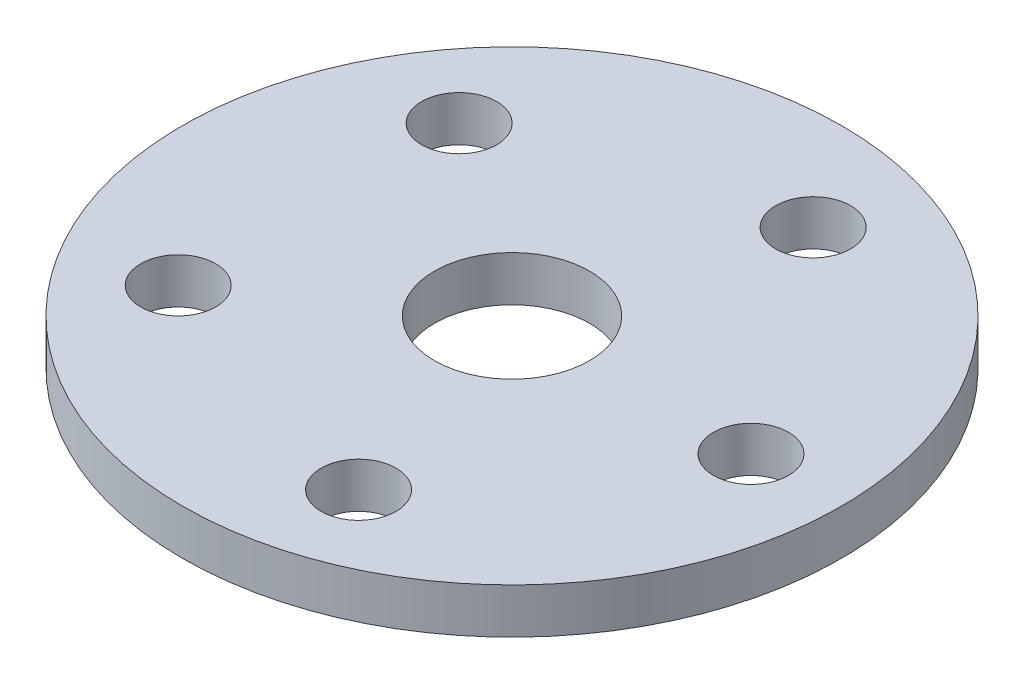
ISO-10303-21;
HEADER;
FILE_DESCRIPTION(('STEP AP214'),'2;1');
FILE_NAME('part.step','',(''),(''),'','','');
FILE_SCHEMA(('AUTOMOTIVE_DESIGN { 1 0 10303 214 1 1 1 1 }'));
ENDSEC;
DATA;
#1=APPLICATION_CONTEXT('core data for automotive mechanical design processes');
#2=APPLICATION_PROTOCOL_DEFINITION('international standard','automotive_design',2000,#1);
#3=PRODUCT_CONTEXT('',#1,'mechanical');
#4=PRODUCT('Part','Part','',(#3));
#5=PRODUCT_RELATED_PRODUCT_CATEGORY('part','',(#4));
#6=PRODUCT_DEFINITION_FORMATION('','',#4);
#7=PRODUCT_DEFINITION_CONTEXT('part definition',#1,'design');
#8=PRODUCT_DEFINITION('design','',#6,#7);
#9=PRODUCT_DEFINITION_SHAPE('','',#8);
#10=(LENGTH_UNIT() NAMED_UNIT(*) SI_UNIT(.MILLI.,.METRE.));
#11=(NAMED_UNIT(*) PLANE_ANGLE_UNIT() SI_UNIT($,.RADIAN.));
#12=(NAMED_UNIT(*) SI_UNIT($,.STERADIAN.) SOLID_ANGLE_UNIT());
#13=UNCERTAINTY_MEASURE_WITH_UNIT(LENGTH_MEASURE(1.E-05),#10,'distance_accuracy_value','');
#14=(GEOMETRIC_REPRESENTATION_CONTEXT(3) GLOBAL_UNCERTAINTY_ASSIGNED_CONTEXT((#13)) GLOBAL_UNIT_ASSIGNED_CONTEXT((#10,
#11,#12)) REPRESENTATION_CONTEXT('',''));
#15=CARTESIAN_POINT('',(0.,0.,0.));
#16=DIRECTION('',(0.,0.,1.));
#17=DIRECTION('',(1.,0.,0.));
#18=AXIS2_PLACEMENT_3D('',#15,#16,#17);
#19=CARTESIAN_POINT('',(0.,8.89,0.));
#20=DIRECTION('',(0.,-1.,0.));
#21=DIRECTION('',(0.,0.,-1.));
#22=AXIS2_PLACEMENT_3D('',#19,#20,#21);
#23=CYLINDRICAL_SURFACE('',#22,64.7558655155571);
#24=CARTESIAN_POINT('',(0.,8.89,0.));
#25=DIRECTION('',(0.,1.,0.));
#26=DIRECTION('',(0.,0.,1.));
#27=AXIS2_PLACEMENT_3D('',#24,#25,#26);
#28=CIRCLE('',#27,64.7558655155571);
#29=CARTESIAN_POINT('',(0.,8.89,64.7558655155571));
#30=VERTEX_POINT('',#29);
#31=EDGE_CURVE('E10',#30,#30,#28,.T.);
#32=ORIENTED_EDGE('',*,*,#31,.F.);
#33=EDGE_LOOP('',(#32));
#34=FACE_BOUND('',#33,.T.);
#35=CARTESIAN_POINT('',(0.,0.,0.));
#36=DIRECTION('',(0.,1.,0.));
#37=DIRECTION('',(0.,0.,1.));
#38=AXIS2_PLACEMENT_3D('',#35,#36,#37);
#39=CIRCLE('',#38,64.7558655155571);
#40=CARTESIAN_POINT('',(0.,0.,64.7558655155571));
#41=VERTEX_POINT('',#40);
#42=EDGE_CURVE('E31',#41,#41,#39,.T.);
#43=ORIENTED_EDGE('',*,*,#42,.T.);
#44=EDGE_LOOP('',(#43));
#45=FACE_BOUND('',#44,.T.);
#46=ADVANCED_FACE('F28',(#34,#45),#23,.T.);
#47=CARTESIAN_POINT('',(0.,8.89,0.));
#48=DIRECTION('',(0.,1.,0.));
#49=DIRECTION('',(0.,0.,1.));
#50=AXIS2_PLACEMENT_3D('',#47,#48,#49);
#51=PLANE('',#50);
#52=CARTESIAN_POINT('',(14.5105613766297,8.89,-44.6589158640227));
#53=DIRECTION('',(0.,1.,0.));
#54=DIRECTION('',(0.95105651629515,0.,0.309016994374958));
#55=AXIS2_PLACEMENT_3D('',#52,#53,#54);
#56=CIRCLE('',#55,7.36688649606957);
#57=CARTESIAN_POINT('',(21.5168867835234,8.89,-42.3824227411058));
#58=VERTEX_POINT('',#57);
#59=EDGE_CURVE('E70',#58,#58,#56,.T.);
#60=ORIENTED_EDGE('',*,*,#59,.F.);
#61=EDGE_LOOP('',(#60));
#62=FACE_BOUND('',#61,.T.);
#63=CARTESIAN_POINT('',(-37.9891428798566,8.89,-27.6007279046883));
#64=DIRECTION('',(0.,1.,0.));
#65=DIRECTION('',(0.58778525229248,0.,-0.809016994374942));
#66=AXIS2_PLACEMENT_3D('',#63,#64,#65);
#67=CIRCLE('',#66,7.36688649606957);
#68=CARTESIAN_POINT('',(-33.6589956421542,8.89,-33.5606642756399));
#69=VERTEX_POINT('',#68);
#70=EDGE_CURVE('E64',#69,#69,#67,.T.);
#71=ORIENTED_EDGE('',*,*,#70,.F.);
#72=EDGE_LOOP('',(#71));
#73=FACE_BOUND('',#72,.T.);
#74=CARTESIAN_POINT('',(-37.9891428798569,8.89,27.6007279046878));
#75=DIRECTION('',(0.,1.,0.));
#76=DIRECTION('',(-0.587785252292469,0.,-0.809016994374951));
#77=AXIS2_PLACEMENT_3D('',#74,#75,#76);
#78=CIRCLE('',#77,7.36688649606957);
#79=CARTESIAN_POINT('',(-42.3192901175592,8.89,21.6407915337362));
#80=VERTEX_POINT('',#79);
#81=EDGE_CURVE('E58',#80,#80,#78,.T.);
#82=ORIENTED_EDGE('',*,*,#81,.F.);
#83=EDGE_LOOP('',(#82));
#84=FACE_BOUND('',#83,.T.);
#85=CARTESIAN_POINT('',(14.5105613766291,8.89,44.6589158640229));
#86=DIRECTION('',(0.,1.,0.));
#87=DIRECTION('',(-0.951056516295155,0.,0.309016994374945));
#88=AXIS2_PLACEMENT_3D('',#85,#86,#87);
#89=CIRCLE('',#88,7.36688649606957);
#90=CARTESIAN_POINT('',(7.50423596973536,8.89,46.9354089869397));
#91=VERTEX_POINT('',#90);
#92=EDGE_CURVE('E52',#91,#91,#89,.T.);
#93=ORIENTED_EDGE('',*,*,#92,.F.);
#94=EDGE_LOOP('',(#93));
#95=FACE_BOUND('',#94,.T.);
#96=CARTESIAN_POINT('',(0.,8.89,0.));
#97=DIRECTION('',(0.,1.,0.));
#98=DIRECTION('',(0.,0.,1.));
#99=AXIS2_PLACEMENT_3D('',#96,#97,#98);
#100=CIRCLE('',#99,15.2460914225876);
#101=CARTESIAN_POINT('',(0.,8.89,15.2460914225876));
#102=VERTEX_POINT('',#101);
#103=EDGE_CURVE('E46',#102,#102,#100,.T.);
#104=ORIENTED_EDGE('',*,*,#103,.F.);
#105=EDGE_LOOP('',(#104));
#106=FACE_BOUND('',#105,.T.);
#107=CARTESIAN_POINT('',(46.9571630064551,8.89,0.));
#108=DIRECTION('',(0.,1.,0.));
#109=DIRECTION('',(0.,0.,1.));
#110=AXIS2_PLACEMENT_3D('',#107,#108,#109);
#111=CIRCLE('',#110,7.36688649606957);
#112=CARTESIAN_POINT('',(46.9571630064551,8.89,7.36688649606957));
#113=VERTEX_POINT('',#112);
#114=EDGE_CURVE('E40',#113,#113,#111,.T.);
#115=ORIENTED_EDGE('',*,*,#114,.F.);
#116=EDGE_LOOP('',(#115));
#117=FACE_BOUND('',#116,.T.);
#118=ORIENTED_EDGE('',*,*,#31,.T.);
#119=EDGE_LOOP('',(#118));
#120=FACE_BOUND('',#119,.T.);
#121=ADVANCED_FACE('F86',(#62,#73,#84,#95,#106,#117,#120),#51,.T.);
#122=CARTESIAN_POINT('',(0.,0.,0.));
#123=DIRECTION('',(0.,1.,0.));
#124=DIRECTION('',(0.,0.,1.));
#125=AXIS2_PLACEMENT_3D('',#122,#123,#124);
#126=PLANE('',#125);
#127=CARTESIAN_POINT('',(14.5105613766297,0.,-44.6589158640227));
#128=DIRECTION('',(0.,1.,0.));
#129=DIRECTION('',(0.95105651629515,0.,0.309016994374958));
#130=AXIS2_PLACEMENT_3D('',#127,#128,#129);
#131=CIRCLE('',#130,7.36688649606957);
#132=CARTESIAN_POINT('',(21.5168867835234,0.,-42.3824227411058));
#133=VERTEX_POINT('',#132);
#134=EDGE_CURVE('E67',#133,#133,#131,.T.);
#135=ORIENTED_EDGE('',*,*,#134,.T.);
#136=EDGE_LOOP('',(#135));
#137=FACE_BOUND('',#136,.T.);
#138=CARTESIAN_POINT('',(-37.9891428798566,0.,-27.6007279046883));
#139=DIRECTION('',(0.,1.,0.));
#140=DIRECTION('',(0.58778525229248,0.,-0.809016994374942));
#141=AXIS2_PLACEMENT_3D('',#138,#139,#140);
#142=CIRCLE('',#141,7.36688649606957);
#143=CARTESIAN_POINT('',(-33.6589956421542,0.,-33.5606642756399));
#144=VERTEX_POINT('',#143);
#145=EDGE_CURVE('E61',#144,#144,#142,.T.);
#146=ORIENTED_EDGE('',*,*,#145,.T.);
#147=EDGE_LOOP('',(#146));
#148=FACE_BOUND('',#147,.T.);
#149=CARTESIAN_POINT('',(-37.9891428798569,0.,27.6007279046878));
#150=DIRECTION('',(0.,1.,0.));
#151=DIRECTION('',(-0.587785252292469,0.,-0.809016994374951));
#152=AXIS2_PLACEMENT_3D('',#149,#150,#151);
#153=CIRCLE('',#152,7.36688649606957);
#154=CARTESIAN_POINT('',(-42.3192901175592,0.,21.6407915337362));
#155=VERTEX_POINT('',#154);
#156=EDGE_CURVE('E55',#155,#155,#153,.T.);
#157=ORIENTED_EDGE('',*,*,#156,.T.);
#158=EDGE_LOOP('',(#157));
#159=FACE_BOUND('',#158,.T.);
#160=CARTESIAN_POINT('',(14.5105613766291,0.,44.6589158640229));
#161=DIRECTION('',(0.,1.,0.));
#162=DIRECTION('',(-0.951056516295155,0.,0.309016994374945));
#163=AXIS2_PLACEMENT_3D('',#160,#161,#162);
#164=CIRCLE('',#163,7.36688649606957);
#165=CARTESIAN_POINT('',(7.50423596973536,0.,46.9354089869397));
#166=VERTEX_POINT('',#165);
#167=EDGE_CURVE('E49',#166,#166,#164,.T.);
#168=ORIENTED_EDGE('',*,*,#167,.T.);
#169=EDGE_LOOP('',(#168));
#170=FACE_BOUND('',#169,.T.);
#171=CARTESIAN_POINT('',(0.,0.,0.));
#172=DIRECTION('',(0.,1.,0.));
#173=DIRECTION('',(0.,0.,1.));
#174=AXIS2_PLACEMENT_3D('',#171,#172,#173);
#175=CIRCLE('',#174,15.2460914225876);
#176=CARTESIAN_POINT('',(0.,0.,15.2460914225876));
#177=VERTEX_POINT('',#176);
#178=EDGE_CURVE('E43',#177,#177,#175,.T.);
#179=ORIENTED_EDGE('',*,*,#178,.T.);
#180=EDGE_LOOP('',(#179));
#181=FACE_BOUND('',#180,.T.);
#182=CARTESIAN_POINT('',(46.9571630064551,0.,0.));
#183=DIRECTION('',(0.,1.,0.));
#184=DIRECTION('',(0.,0.,1.));
#185=AXIS2_PLACEMENT_3D('',#182,#183,#184);
#186=CIRCLE('',#185,7.36688649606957);
#187=CARTESIAN_POINT('',(46.9571630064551,0.,7.36688649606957));
#188=VERTEX_POINT('',#187);
#189=EDGE_CURVE('E38',#188,#188,#186,.T.);
#190=ORIENTED_EDGE('',*,*,#189,.T.);
#191=EDGE_LOOP('',(#190));
#192=FACE_BOUND('',#191,.T.);
#193=ORIENTED_EDGE('',*,*,#42,.F.);
#194=EDGE_LOOP('',(#193));
#195=FACE_BOUND('',#194,.T.);
#196=ADVANCED_FACE('F76',(#137,#148,#159,#170,#181,#192,#195),#126,.F.);
#197=CARTESIAN_POINT('',(46.9571630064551,0.,0.));
#198=DIRECTION('',(0.,1.,0.));
#199=DIRECTION('',(0.,0.,1.));
#200=AXIS2_PLACEMENT_3D('',#197,#198,#199);
#201=CYLINDRICAL_SURFACE('',#200,7.36688649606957);
#202=ORIENTED_EDGE('',*,*,#189,.F.);
#203=EDGE_LOOP('',(#202));
#204=FACE_BOUND('',#203,.T.);
#205=ORIENTED_EDGE('',*,*,#114,.T.);
#206=EDGE_LOOP('',(#205));
#207=FACE_BOUND('',#206,.T.);
#208=ADVANCED_FACE('F100',(#204,#207),#201,.F.);
#209=CARTESIAN_POINT('',(0.,0.,0.));
#210=DIRECTION('',(0.,1.,0.));
#211=DIRECTION('',(0.,0.,1.));
#212=AXIS2_PLACEMENT_3D('',#209,#210,#211);
#213=CYLINDRICAL_SURFACE('',#212,15.2460914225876);
#214=ORIENTED_EDGE('',*,*,#178,.F.);
#215=EDGE_LOOP('',(#214));
#216=FACE_BOUND('',#215,.T.);
#217=ORIENTED_EDGE('',*,*,#103,.T.);
#218=EDGE_LOOP('',(#217));
#219=FACE_BOUND('',#218,.T.);
#220=ADVANCED_FACE('F102',(#216,#219),#213,.F.);
#221=CARTESIAN_POINT('',(14.5105613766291,0.,44.6589158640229));
#222=DIRECTION('',(0.,1.,0.));
#223=DIRECTION('',(0.,0.,1.));
#224=AXIS2_PLACEMENT_3D('',#221,#222,#223);
#225=CYLINDRICAL_SURFACE('',#224,7.36688649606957);
#226=ORIENTED_EDGE('',*,*,#167,.F.);
#227=EDGE_LOOP('',(#226));
#228=FACE_BOUND('',#227,.T.);
#229=ORIENTED_EDGE('',*,*,#92,.T.);
#230=EDGE_LOOP('',(#229));
#231=FACE_BOUND('',#230,.T.);
#232=ADVANCED_FACE('F109',(#228,#231),#225,.F.);
#233=CARTESIAN_POINT('',(-37.9891428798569,0.,27.6007279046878));
#234=DIRECTION('',(0.,1.,0.));
#235=DIRECTION('',(0.,0.,1.));
#236=AXIS2_PLACEMENT_3D('',#233,#234,#235);
#237=CYLINDRICAL_SURFACE('',#236,7.36688649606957);
#238=ORIENTED_EDGE('',*,*,#156,.F.);
#239=EDGE_LOOP('',(#238));
#240=FACE_BOUND('',#239,.T.);
#241=ORIENTED_EDGE('',*,*,#81,.T.);
#242=EDGE_LOOP('',(#241));
#243=FACE_BOUND('',#242,.T.);
#244=ADVANCED_FACE('F139',(#240,#243),#237,.F.);
#245=CARTESIAN_POINT('',(-37.9891428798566,0.,-27.6007279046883));
#246=DIRECTION('',(0.,1.,0.));
#247=DIRECTION('',(0.,0.,1.));
#248=AXIS2_PLACEMENT_3D('',#245,#246,#247);
#249=CYLINDRICAL_SURFACE('',#248,7.36688649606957);
#250=ORIENTED_EDGE('',*,*,#145,.F.);
#251=EDGE_LOOP('',(#250));
#252=FACE_BOUND('',#251,.T.);
#253=ORIENTED_EDGE('',*,*,#70,.T.);
#254=EDGE_LOOP('',(#253));
#255=FACE_BOUND('',#254,.T.);
#256=ADVANCED_FACE('F82',(#252,#255),#249,.F.);
#257=CARTESIAN_POINT('',(14.5105613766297,0.,-44.6589158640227));
#258=DIRECTION('',(0.,1.,0.));
#259=DIRECTION('',(0.,0.,1.));
#260=AXIS2_PLACEMENT_3D('',#257,#258,#259);
#261=CYLINDRICAL_SURFACE('',#260,7.36688649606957);
#262=ORIENTED_EDGE('',*,*,#134,.F.);
#263=EDGE_LOOP('',(#262));
#264=FACE_BOUND('',#263,.T.);
#265=ORIENTED_EDGE('',*,*,#59,.T.);
#266=EDGE_LOOP('',(#265));
#267=FACE_BOUND('',#266,.T.);
#268=ADVANCED_FACE('F79',(#264,#267),#261,.F.);
#269=CLOSED_SHELL('',(#46,#121,#196,#208,#220,#232,#244,#256,#268));
#270=MANIFOLD_SOLID_BREP('B2',#269);
#271=ADVANCED_BREP_SHAPE_REPRESENTATION('',(#18,#270),#14);
#272=SHAPE_DEFINITION_REPRESENTATION(#9,#271);
ENDSEC;
END-ISO-10303-21;
